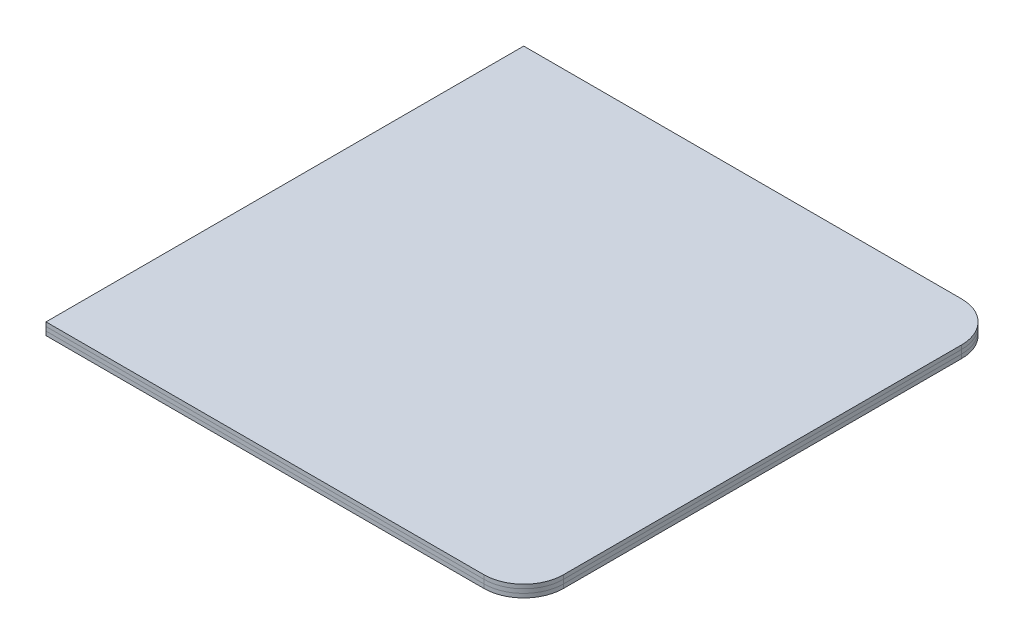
ISO-10303-21;
HEADER;
FILE_DESCRIPTION(('STEP AP214'),'2;1');
FILE_NAME('part.step','',(''),(''),'','','');
FILE_SCHEMA(('AUTOMOTIVE_DESIGN { 1 0 10303 214 1 1 1 1 }'));
ENDSEC;
DATA;
#1=APPLICATION_CONTEXT('core data for automotive mechanical design processes');
#2=APPLICATION_PROTOCOL_DEFINITION('international standard','automotive_design',2000,#1);
#3=PRODUCT_CONTEXT('',#1,'mechanical');
#4=PRODUCT('Part','Part','',(#3));
#5=PRODUCT_RELATED_PRODUCT_CATEGORY('part','',(#4));
#6=PRODUCT_DEFINITION_FORMATION('','',#4);
#7=PRODUCT_DEFINITION_CONTEXT('part definition',#1,'design');
#8=PRODUCT_DEFINITION('design','',#6,#7);
#9=PRODUCT_DEFINITION_SHAPE('','',#8);
#10=(LENGTH_UNIT() NAMED_UNIT(*) SI_UNIT(.MILLI.,.METRE.));
#11=(NAMED_UNIT(*) PLANE_ANGLE_UNIT() SI_UNIT($,.RADIAN.));
#12=(NAMED_UNIT(*) SI_UNIT($,.STERADIAN.) SOLID_ANGLE_UNIT());
#13=UNCERTAINTY_MEASURE_WITH_UNIT(LENGTH_MEASURE(1.E-05),#10,'distance_accuracy_value','');
#14=(GEOMETRIC_REPRESENTATION_CONTEXT(3) GLOBAL_UNCERTAINTY_ASSIGNED_CONTEXT((#13)) GLOBAL_UNIT_ASSIGNED_CONTEXT((#10,
#11,#12)) REPRESENTATION_CONTEXT('',''));
#15=CARTESIAN_POINT('',(0.,0.,0.));
#16=DIRECTION('',(0.,0.,1.));
#17=DIRECTION('',(1.,0.,0.));
#18=AXIS2_PLACEMENT_3D('',#15,#16,#17);
#19=CARTESIAN_POINT('',(-60.1958,3.,60.0396));
#20=DIRECTION('',(1.,0.,0.));
#21=DIRECTION('',(0.,0.,-1.));
#22=AXIS2_PLACEMENT_3D('',#19,#20,#21);
#23=PLANE('',#22);
#24=DIRECTION('',(0.,0.,1.));
#25=VECTOR('',#24,1.);
#26=CARTESIAN_POINT('',(-60.1958,2.,60.0396));
#27=LINE('',#26,#25);
#28=CARTESIAN_POINT('',(-60.1958,2.,-59.9604));
#29=VERTEX_POINT('',#28);
#30=CARTESIAN_POINT('',(-60.1958,2.,60.0396));
#31=VERTEX_POINT('',#30);
#32=EDGE_CURVE('E130',#29,#31,#27,.T.);
#33=ORIENTED_EDGE('',*,*,#32,.T.);
#34=DIRECTION('',(0.,-1.,0.));
#35=VECTOR('',#34,1.);
#36=CARTESIAN_POINT('',(-60.1958,3.,60.0396));
#37=LINE('',#36,#35);
#38=CARTESIAN_POINT('',(-60.1958,3.,60.0396));
#39=VERTEX_POINT('',#38);
#40=EDGE_CURVE('E12',#39,#31,#37,.T.);
#41=ORIENTED_EDGE('',*,*,#40,.F.);
#42=DIRECTION('',(0.,0.,1.));
#43=VECTOR('',#42,1.);
#44=CARTESIAN_POINT('',(-60.1958,3.,60.0396));
#45=LINE('',#44,#43);
#46=CARTESIAN_POINT('',(-60.1958,3.,-59.9604));
#47=VERTEX_POINT('',#46);
#48=EDGE_CURVE('E140',#47,#39,#45,.T.);
#49=ORIENTED_EDGE('',*,*,#48,.F.);
#50=DIRECTION('',(0.,-1.,0.));
#51=VECTOR('',#50,1.);
#52=CARTESIAN_POINT('',(-60.1958,3.,-59.9604));
#53=LINE('',#52,#51);
#54=EDGE_CURVE('E126',#47,#29,#53,.T.);
#55=ORIENTED_EDGE('',*,*,#54,.T.);
#56=EDGE_LOOP('',(#33,#41,#49,#55));
#57=FACE_BOUND('',#56,.T.);
#58=ADVANCED_FACE('F46',(#57),#23,.F.);
#59=CARTESIAN_POINT('',(49.8042,3.,60.0396));
#60=DIRECTION('',(0.,0.,-1.));
#61=DIRECTION('',(-1.,0.,0.));
#62=AXIS2_PLACEMENT_3D('',#59,#60,#61);
#63=PLANE('',#62);
#64=DIRECTION('',(1.,0.,0.));
#65=VECTOR('',#64,1.);
#66=CARTESIAN_POINT('',(49.8042,2.,60.0396));
#67=LINE('',#66,#65);
#68=CARTESIAN_POINT('',(49.8042,2.,60.0396));
#69=VERTEX_POINT('',#68);
#70=EDGE_CURVE('E133',#31,#69,#67,.T.);
#71=ORIENTED_EDGE('',*,*,#70,.T.);
#72=DIRECTION('',(0.,-1.,0.));
#73=VECTOR('',#72,1.);
#74=CARTESIAN_POINT('',(49.8042,3.,60.0396));
#75=LINE('',#74,#73);
#76=CARTESIAN_POINT('',(49.8042,3.,60.0396));
#77=VERTEX_POINT('',#76);
#78=EDGE_CURVE('E54',#77,#69,#75,.T.);
#79=ORIENTED_EDGE('',*,*,#78,.F.);
#80=DIRECTION('',(1.,0.,0.));
#81=VECTOR('',#80,1.);
#82=CARTESIAN_POINT('',(49.8042,3.,60.0396));
#83=LINE('',#82,#81);
#84=EDGE_CURVE('E99',#39,#77,#83,.T.);
#85=ORIENTED_EDGE('',*,*,#84,.F.);
#86=ORIENTED_EDGE('',*,*,#40,.T.);
#87=EDGE_LOOP('',(#71,#79,#85,#86));
#88=FACE_BOUND('',#87,.T.);
#89=ADVANCED_FACE('F164',(#88),#63,.F.);
#90=CARTESIAN_POINT('',(49.8042,3.,50.0396));
#91=DIRECTION('',(0.,-1.,0.));
#92=DIRECTION('',(0.,0.,-1.));
#93=AXIS2_PLACEMENT_3D('',#90,#91,#92);
#94=CYLINDRICAL_SURFACE('',#93,10.);
#95=CARTESIAN_POINT('',(49.8042,2.,50.0396));
#96=DIRECTION('',(0.,1.,0.));
#97=DIRECTION('',(0.,0.,1.));
#98=AXIS2_PLACEMENT_3D('',#95,#96,#97);
#99=CIRCLE('',#98,10.);
#100=CARTESIAN_POINT('',(59.8042,2.,50.0396));
#101=VERTEX_POINT('',#100);
#102=EDGE_CURVE('E135',#69,#101,#99,.T.);
#103=ORIENTED_EDGE('',*,*,#102,.T.);
#104=DIRECTION('',(0.,-1.,0.));
#105=VECTOR('',#104,1.);
#106=CARTESIAN_POINT('',(59.8042,3.,50.0396));
#107=LINE('',#106,#105);
#108=CARTESIAN_POINT('',(59.8042,3.,50.0396));
#109=VERTEX_POINT('',#108);
#110=EDGE_CURVE('E121',#109,#101,#107,.T.);
#111=ORIENTED_EDGE('',*,*,#110,.F.);
#112=CARTESIAN_POINT('',(49.8042,3.,50.0396));
#113=DIRECTION('',(0.,1.,0.));
#114=DIRECTION('',(0.,0.,1.));
#115=AXIS2_PLACEMENT_3D('',#112,#113,#114);
#116=CIRCLE('',#115,10.);
#117=EDGE_CURVE('E112',#77,#109,#116,.T.);
#118=ORIENTED_EDGE('',*,*,#117,.F.);
#119=ORIENTED_EDGE('',*,*,#78,.T.);
#120=EDGE_LOOP('',(#103,#111,#118,#119));
#121=FACE_BOUND('',#120,.T.);
#122=ADVANCED_FACE('F146',(#121),#94,.T.);
#123=CARTESIAN_POINT('',(59.8042,3.,-49.9604));
#124=DIRECTION('',(-1.,0.,0.));
#125=DIRECTION('',(0.,0.,1.));
#126=AXIS2_PLACEMENT_3D('',#123,#124,#125);
#127=PLANE('',#126);
#128=DIRECTION('',(0.,0.,-1.));
#129=VECTOR('',#128,1.);
#130=CARTESIAN_POINT('',(59.8042,2.,-49.9604));
#131=LINE('',#130,#129);
#132=CARTESIAN_POINT('',(59.8042,2.,-49.9604));
#133=VERTEX_POINT('',#132);
#134=EDGE_CURVE('E120',#101,#133,#131,.T.);
#135=ORIENTED_EDGE('',*,*,#134,.T.);
#136=DIRECTION('',(0.,-1.,0.));
#137=VECTOR('',#136,1.);
#138=CARTESIAN_POINT('',(59.8042,3.,-49.9604));
#139=LINE('',#138,#137);
#140=CARTESIAN_POINT('',(59.8042,3.,-49.9604));
#141=VERTEX_POINT('',#140);
#142=EDGE_CURVE('E117',#141,#133,#139,.T.);
#143=ORIENTED_EDGE('',*,*,#142,.F.);
#144=DIRECTION('',(0.,0.,-1.));
#145=VECTOR('',#144,1.);
#146=CARTESIAN_POINT('',(59.8042,3.,-49.9604));
#147=LINE('',#146,#145);
#148=EDGE_CURVE('E106',#109,#141,#147,.T.);
#149=ORIENTED_EDGE('',*,*,#148,.F.);
#150=ORIENTED_EDGE('',*,*,#110,.T.);
#151=EDGE_LOOP('',(#135,#143,#149,#150));
#152=FACE_BOUND('',#151,.T.);
#153=ADVANCED_FACE('F118',(#152),#127,.F.);
#154=CARTESIAN_POINT('',(49.8042,3.,-49.9604));
#155=DIRECTION('',(0.,-1.,0.));
#156=DIRECTION('',(0.,0.,-1.));
#157=AXIS2_PLACEMENT_3D('',#154,#155,#156);
#158=CYLINDRICAL_SURFACE('',#157,10.);
#159=CARTESIAN_POINT('',(49.8042,2.,-49.9604));
#160=DIRECTION('',(0.,1.,0.));
#161=DIRECTION('',(0.,0.,-1.));
#162=AXIS2_PLACEMENT_3D('',#159,#160,#161);
#163=CIRCLE('',#162,10.);
#164=CARTESIAN_POINT('',(49.8042,2.,-59.9604));
#165=VERTEX_POINT('',#164);
#166=EDGE_CURVE('E85',#133,#165,#163,.T.);
#167=ORIENTED_EDGE('',*,*,#166,.T.);
#168=DIRECTION('',(0.,-1.,0.));
#169=VECTOR('',#168,1.);
#170=CARTESIAN_POINT('',(49.8042,3.,-59.9604));
#171=LINE('',#170,#169);
#172=CARTESIAN_POINT('',(49.8042,3.,-59.9604));
#173=VERTEX_POINT('',#172);
#174=EDGE_CURVE('E122',#173,#165,#171,.T.);
#175=ORIENTED_EDGE('',*,*,#174,.F.);
#176=CARTESIAN_POINT('',(49.8042,3.,-49.9604));
#177=DIRECTION('',(0.,1.,0.));
#178=DIRECTION('',(0.,0.,-1.));
#179=AXIS2_PLACEMENT_3D('',#176,#177,#178);
#180=CIRCLE('',#179,10.);
#181=EDGE_CURVE('E110',#141,#173,#180,.T.);
#182=ORIENTED_EDGE('',*,*,#181,.F.);
#183=ORIENTED_EDGE('',*,*,#142,.T.);
#184=EDGE_LOOP('',(#167,#175,#182,#183));
#185=FACE_BOUND('',#184,.T.);
#186=ADVANCED_FACE('F124',(#185),#158,.T.);
#187=CARTESIAN_POINT('',(-60.1958,3.,-59.9604));
#188=DIRECTION('',(0.,0.,1.));
#189=DIRECTION('',(1.,0.,0.));
#190=AXIS2_PLACEMENT_3D('',#187,#188,#189);
#191=PLANE('',#190);
#192=DIRECTION('',(-1.,0.,0.));
#193=VECTOR('',#192,1.);
#194=CARTESIAN_POINT('',(-60.1958,2.,-59.9604));
#195=LINE('',#194,#193);
#196=EDGE_CURVE('E91',#165,#29,#195,.T.);
#197=ORIENTED_EDGE('',*,*,#196,.T.);
#198=ORIENTED_EDGE('',*,*,#54,.F.);
#199=DIRECTION('',(-1.,0.,0.));
#200=VECTOR('',#199,1.);
#201=CARTESIAN_POINT('',(-60.1958,3.,-59.9604));
#202=LINE('',#201,#200);
#203=EDGE_CURVE('E62',#173,#47,#202,.T.);
#204=ORIENTED_EDGE('',*,*,#203,.F.);
#205=ORIENTED_EDGE('',*,*,#174,.T.);
#206=EDGE_LOOP('',(#197,#198,#204,#205));
#207=FACE_BOUND('',#206,.T.);
#208=ADVANCED_FACE('F153',(#207),#191,.F.);
#209=CARTESIAN_POINT('',(49.8042,3.,-49.9604));
#210=DIRECTION('',(0.,-1.,0.));
#211=DIRECTION('',(0.,0.,-1.));
#212=AXIS2_PLACEMENT_3D('',#209,#210,#211);
#213=PLANE('',#212);
#214=ORIENTED_EDGE('',*,*,#48,.T.);
#215=ORIENTED_EDGE('',*,*,#84,.T.);
#216=ORIENTED_EDGE('',*,*,#117,.T.);
#217=ORIENTED_EDGE('',*,*,#148,.T.);
#218=ORIENTED_EDGE('',*,*,#181,.T.);
#219=ORIENTED_EDGE('',*,*,#203,.T.);
#220=EDGE_LOOP('',(#214,#215,#216,#217,#218,#219));
#221=FACE_BOUND('',#220,.T.);
#222=ADVANCED_FACE('F108',(#221),#213,.F.);
#223=CARTESIAN_POINT('',(49.8042,2.,-49.9604));
#224=DIRECTION('',(0.,-1.,0.));
#225=DIRECTION('',(0.,0.,-1.));
#226=AXIS2_PLACEMENT_3D('',#223,#224,#225);
#227=PLANE('',#226);
#228=ORIENTED_EDGE('',*,*,#32,.F.);
#229=ORIENTED_EDGE('',*,*,#196,.F.);
#230=ORIENTED_EDGE('',*,*,#166,.F.);
#231=ORIENTED_EDGE('',*,*,#134,.F.);
#232=ORIENTED_EDGE('',*,*,#102,.F.);
#233=ORIENTED_EDGE('',*,*,#70,.F.);
#234=EDGE_LOOP('',(#228,#229,#230,#231,#232,#233));
#235=FACE_BOUND('',#234,.T.);
#236=ADVANCED_FACE('F149',(#235),#227,.T.);
#237=CLOSED_SHELL('',(#58,#89,#122,#153,#186,#208,#222,#236));
#238=MANIFOLD_SOLID_BREP('B2',#237);
#239=CARTESIAN_POINT('',(-60.1958,2.,60.0396));
#240=DIRECTION('',(1.,0.,0.));
#241=DIRECTION('',(0.,0.,-1.));
#242=AXIS2_PLACEMENT_3D('',#239,#240,#241);
#243=PLANE('',#242);
#244=DIRECTION('',(0.,0.,1.));
#245=VECTOR('',#244,1.);
#246=CARTESIAN_POINT('',(-60.1958,1.,60.0396));
#247=LINE('',#246,#245);
#248=CARTESIAN_POINT('',(-60.1958,1.,-59.9604));
#249=VERTEX_POINT('',#248);
#250=CARTESIAN_POINT('',(-60.1958,1.,60.0396));
#251=VERTEX_POINT('',#250);
#252=EDGE_CURVE('E315',#249,#251,#247,.T.);
#253=ORIENTED_EDGE('',*,*,#252,.T.);
#254=DIRECTION('',(0.,-1.,0.));
#255=VECTOR('',#254,1.);
#256=CARTESIAN_POINT('',(-60.1958,2.,60.0396));
#257=LINE('',#256,#255);
#258=CARTESIAN_POINT('',(-60.1958,2.,60.0396));
#259=VERTEX_POINT('',#258);
#260=EDGE_CURVE('E44',#259,#251,#257,.T.);
#261=ORIENTED_EDGE('',*,*,#260,.F.);
#262=DIRECTION('',(0.,0.,1.));
#263=VECTOR('',#262,1.);
#264=CARTESIAN_POINT('',(-60.1958,2.,60.0396));
#265=LINE('',#264,#263);
#266=CARTESIAN_POINT('',(-60.1958,2.,-59.9604));
#267=VERTEX_POINT('',#266);
#268=EDGE_CURVE('E325',#267,#259,#265,.T.);
#269=ORIENTED_EDGE('',*,*,#268,.F.);
#270=DIRECTION('',(0.,-1.,0.));
#271=VECTOR('',#270,1.);
#272=CARTESIAN_POINT('',(-60.1958,2.,-59.9604));
#273=LINE('',#272,#271);
#274=EDGE_CURVE('E311',#267,#249,#273,.T.);
#275=ORIENTED_EDGE('',*,*,#274,.T.);
#276=EDGE_LOOP('',(#253,#261,#269,#275));
#277=FACE_BOUND('',#276,.T.);
#278=ADVANCED_FACE('F231',(#277),#243,.F.);
#279=CARTESIAN_POINT('',(49.8042,2.,60.0396));
#280=DIRECTION('',(0.,0.,-1.));
#281=DIRECTION('',(-1.,0.,0.));
#282=AXIS2_PLACEMENT_3D('',#279,#280,#281);
#283=PLANE('',#282);
#284=DIRECTION('',(1.,0.,0.));
#285=VECTOR('',#284,1.);
#286=CARTESIAN_POINT('',(49.8042,1.,60.0396));
#287=LINE('',#286,#285);
#288=CARTESIAN_POINT('',(49.8042,1.,60.0396));
#289=VERTEX_POINT('',#288);
#290=EDGE_CURVE('E318',#251,#289,#287,.T.);
#291=ORIENTED_EDGE('',*,*,#290,.T.);
#292=DIRECTION('',(0.,-1.,0.));
#293=VECTOR('',#292,1.);
#294=CARTESIAN_POINT('',(49.8042,2.,60.0396));
#295=LINE('',#294,#293);
#296=CARTESIAN_POINT('',(49.8042,2.,60.0396));
#297=VERTEX_POINT('',#296);
#298=EDGE_CURVE('E239',#297,#289,#295,.T.);
#299=ORIENTED_EDGE('',*,*,#298,.F.);
#300=DIRECTION('',(1.,0.,0.));
#301=VECTOR('',#300,1.);
#302=CARTESIAN_POINT('',(49.8042,2.,60.0396));
#303=LINE('',#302,#301);
#304=EDGE_CURVE('E284',#259,#297,#303,.T.);
#305=ORIENTED_EDGE('',*,*,#304,.F.);
#306=ORIENTED_EDGE('',*,*,#260,.T.);
#307=EDGE_LOOP('',(#291,#299,#305,#306));
#308=FACE_BOUND('',#307,.T.);
#309=ADVANCED_FACE('F349',(#308),#283,.F.);
#310=CARTESIAN_POINT('',(49.8042,2.,50.0396));
#311=DIRECTION('',(0.,-1.,0.));
#312=DIRECTION('',(0.,0.,-1.));
#313=AXIS2_PLACEMENT_3D('',#310,#311,#312);
#314=CYLINDRICAL_SURFACE('',#313,10.);
#315=CARTESIAN_POINT('',(49.8042,1.,50.0396));
#316=DIRECTION('',(0.,1.,0.));
#317=DIRECTION('',(0.,0.,1.));
#318=AXIS2_PLACEMENT_3D('',#315,#316,#317);
#319=CIRCLE('',#318,10.);
#320=CARTESIAN_POINT('',(59.8042,1.,50.0396));
#321=VERTEX_POINT('',#320);
#322=EDGE_CURVE('E320',#289,#321,#319,.T.);
#323=ORIENTED_EDGE('',*,*,#322,.T.);
#324=DIRECTION('',(0.,-1.,0.));
#325=VECTOR('',#324,1.);
#326=CARTESIAN_POINT('',(59.8042,2.,50.0396));
#327=LINE('',#326,#325);
#328=CARTESIAN_POINT('',(59.8042,2.,50.0396));
#329=VERTEX_POINT('',#328);
#330=EDGE_CURVE('E306',#329,#321,#327,.T.);
#331=ORIENTED_EDGE('',*,*,#330,.F.);
#332=CARTESIAN_POINT('',(49.8042,2.,50.0396));
#333=DIRECTION('',(0.,1.,0.));
#334=DIRECTION('',(0.,0.,1.));
#335=AXIS2_PLACEMENT_3D('',#332,#333,#334);
#336=CIRCLE('',#335,10.);
#337=EDGE_CURVE('E297',#297,#329,#336,.T.);
#338=ORIENTED_EDGE('',*,*,#337,.F.);
#339=ORIENTED_EDGE('',*,*,#298,.T.);
#340=EDGE_LOOP('',(#323,#331,#338,#339));
#341=FACE_BOUND('',#340,.T.);
#342=ADVANCED_FACE('F331',(#341),#314,.T.);
#343=CARTESIAN_POINT('',(59.8042,2.,-49.9604));
#344=DIRECTION('',(-1.,0.,0.));
#345=DIRECTION('',(0.,0.,1.));
#346=AXIS2_PLACEMENT_3D('',#343,#344,#345);
#347=PLANE('',#346);
#348=DIRECTION('',(0.,0.,-1.));
#349=VECTOR('',#348,1.);
#350=CARTESIAN_POINT('',(59.8042,1.,-49.9604));
#351=LINE('',#350,#349);
#352=CARTESIAN_POINT('',(59.8042,1.,-49.9604));
#353=VERTEX_POINT('',#352);
#354=EDGE_CURVE('E305',#321,#353,#351,.T.);
#355=ORIENTED_EDGE('',*,*,#354,.T.);
#356=DIRECTION('',(0.,-1.,0.));
#357=VECTOR('',#356,1.);
#358=CARTESIAN_POINT('',(59.8042,2.,-49.9604));
#359=LINE('',#358,#357);
#360=CARTESIAN_POINT('',(59.8042,2.,-49.9604));
#361=VERTEX_POINT('',#360);
#362=EDGE_CURVE('E302',#361,#353,#359,.T.);
#363=ORIENTED_EDGE('',*,*,#362,.F.);
#364=DIRECTION('',(0.,0.,-1.));
#365=VECTOR('',#364,1.);
#366=CARTESIAN_POINT('',(59.8042,2.,-49.9604));
#367=LINE('',#366,#365);
#368=EDGE_CURVE('E291',#329,#361,#367,.T.);
#369=ORIENTED_EDGE('',*,*,#368,.F.);
#370=ORIENTED_EDGE('',*,*,#330,.T.);
#371=EDGE_LOOP('',(#355,#363,#369,#370));
#372=FACE_BOUND('',#371,.T.);
#373=ADVANCED_FACE('F303',(#372),#347,.F.);
#374=CARTESIAN_POINT('',(49.8042,2.,-49.9604));
#375=DIRECTION('',(0.,-1.,0.));
#376=DIRECTION('',(0.,0.,-1.));
#377=AXIS2_PLACEMENT_3D('',#374,#375,#376);
#378=CYLINDRICAL_SURFACE('',#377,10.);
#379=CARTESIAN_POINT('',(49.8042,1.,-49.9604));
#380=DIRECTION('',(0.,1.,0.));
#381=DIRECTION('',(0.,0.,-1.));
#382=AXIS2_PLACEMENT_3D('',#379,#380,#381);
#383=CIRCLE('',#382,10.);
#384=CARTESIAN_POINT('',(49.8042,1.,-59.9604));
#385=VERTEX_POINT('',#384);
#386=EDGE_CURVE('E270',#353,#385,#383,.T.);
#387=ORIENTED_EDGE('',*,*,#386,.T.);
#388=DIRECTION('',(0.,-1.,0.));
#389=VECTOR('',#388,1.);
#390=CARTESIAN_POINT('',(49.8042,2.,-59.9604));
#391=LINE('',#390,#389);
#392=CARTESIAN_POINT('',(49.8042,2.,-59.9604));
#393=VERTEX_POINT('',#392);
#394=EDGE_CURVE('E307',#393,#385,#391,.T.);
#395=ORIENTED_EDGE('',*,*,#394,.F.);
#396=CARTESIAN_POINT('',(49.8042,2.,-49.9604));
#397=DIRECTION('',(0.,1.,0.));
#398=DIRECTION('',(0.,0.,-1.));
#399=AXIS2_PLACEMENT_3D('',#396,#397,#398);
#400=CIRCLE('',#399,10.);
#401=EDGE_CURVE('E295',#361,#393,#400,.T.);
#402=ORIENTED_EDGE('',*,*,#401,.F.);
#403=ORIENTED_EDGE('',*,*,#362,.T.);
#404=EDGE_LOOP('',(#387,#395,#402,#403));
#405=FACE_BOUND('',#404,.T.);
#406=ADVANCED_FACE('F309',(#405),#378,.T.);
#407=CARTESIAN_POINT('',(-60.1958,2.,-59.9604));
#408=DIRECTION('',(0.,0.,1.));
#409=DIRECTION('',(1.,0.,0.));
#410=AXIS2_PLACEMENT_3D('',#407,#408,#409);
#411=PLANE('',#410);
#412=DIRECTION('',(-1.,0.,0.));
#413=VECTOR('',#412,1.);
#414=CARTESIAN_POINT('',(-60.1958,1.,-59.9604));
#415=LINE('',#414,#413);
#416=EDGE_CURVE('E276',#385,#249,#415,.T.);
#417=ORIENTED_EDGE('',*,*,#416,.T.);
#418=ORIENTED_EDGE('',*,*,#274,.F.);
#419=DIRECTION('',(-1.,0.,0.));
#420=VECTOR('',#419,1.);
#421=CARTESIAN_POINT('',(-60.1958,2.,-59.9604));
#422=LINE('',#421,#420);
#423=EDGE_CURVE('E247',#393,#267,#422,.T.);
#424=ORIENTED_EDGE('',*,*,#423,.F.);
#425=ORIENTED_EDGE('',*,*,#394,.T.);
#426=EDGE_LOOP('',(#417,#418,#424,#425));
#427=FACE_BOUND('',#426,.T.);
#428=ADVANCED_FACE('F338',(#427),#411,.F.);
#429=CARTESIAN_POINT('',(49.8042,2.,-49.9604));
#430=DIRECTION('',(0.,-1.,0.));
#431=DIRECTION('',(0.,0.,-1.));
#432=AXIS2_PLACEMENT_3D('',#429,#430,#431);
#433=PLANE('',#432);
#434=ORIENTED_EDGE('',*,*,#268,.T.);
#435=ORIENTED_EDGE('',*,*,#304,.T.);
#436=ORIENTED_EDGE('',*,*,#337,.T.);
#437=ORIENTED_EDGE('',*,*,#368,.T.);
#438=ORIENTED_EDGE('',*,*,#401,.T.);
#439=ORIENTED_EDGE('',*,*,#423,.T.);
#440=EDGE_LOOP('',(#434,#435,#436,#437,#438,#439));
#441=FACE_BOUND('',#440,.T.);
#442=ADVANCED_FACE('F293',(#441),#433,.F.);
#443=CARTESIAN_POINT('',(49.8042,1.,-49.9604));
#444=DIRECTION('',(0.,-1.,0.));
#445=DIRECTION('',(0.,0.,-1.));
#446=AXIS2_PLACEMENT_3D('',#443,#444,#445);
#447=PLANE('',#446);
#448=ORIENTED_EDGE('',*,*,#252,.F.);
#449=ORIENTED_EDGE('',*,*,#416,.F.);
#450=ORIENTED_EDGE('',*,*,#386,.F.);
#451=ORIENTED_EDGE('',*,*,#354,.F.);
#452=ORIENTED_EDGE('',*,*,#322,.F.);
#453=ORIENTED_EDGE('',*,*,#290,.F.);
#454=EDGE_LOOP('',(#448,#449,#450,#451,#452,#453));
#455=FACE_BOUND('',#454,.T.);
#456=ADVANCED_FACE('F334',(#455),#447,.T.);
#457=CLOSED_SHELL('',(#278,#309,#342,#373,#406,#428,#442,#456));
#458=MANIFOLD_SOLID_BREP('B6',#457);
#459=CARTESIAN_POINT('',(-60.1958,1.,60.0396));
#460=DIRECTION('',(1.,0.,0.));
#461=DIRECTION('',(0.,0.,-1.));
#462=AXIS2_PLACEMENT_3D('',#459,#460,#461);
#463=PLANE('',#462);
#464=DIRECTION('',(0.,0.,1.));
#465=VECTOR('',#464,1.);
#466=CARTESIAN_POINT('',(-60.1958,0.,60.0396));
#467=LINE('',#466,#465);
#468=CARTESIAN_POINT('',(-60.1958,0.,-59.9604));
#469=VERTEX_POINT('',#468);
#470=CARTESIAN_POINT('',(-60.1958,0.,60.0396));
#471=VERTEX_POINT('',#470);
#472=EDGE_CURVE('E491',#469,#471,#467,.T.);
#473=ORIENTED_EDGE('',*,*,#472,.T.);
#474=DIRECTION('',(0.,-1.,0.));
#475=VECTOR('',#474,1.);
#476=CARTESIAN_POINT('',(-60.1958,1.,60.0396));
#477=LINE('',#476,#475);
#478=CARTESIAN_POINT('',(-60.1958,1.,60.0396));
#479=VERTEX_POINT('',#478);
#480=EDGE_CURVE('E229',#479,#471,#477,.T.);
#481=ORIENTED_EDGE('',*,*,#480,.F.);
#482=DIRECTION('',(0.,0.,1.));
#483=VECTOR('',#482,1.);
#484=CARTESIAN_POINT('',(-60.1958,1.,60.0396));
#485=LINE('',#484,#483);
#486=CARTESIAN_POINT('',(-60.1958,1.,-59.9604));
#487=VERTEX_POINT('',#486);
#488=EDGE_CURVE('E501',#487,#479,#485,.T.);
#489=ORIENTED_EDGE('',*,*,#488,.F.);
#490=DIRECTION('',(0.,-1.,0.));
#491=VECTOR('',#490,1.);
#492=CARTESIAN_POINT('',(-60.1958,1.,-59.9604));
#493=LINE('',#492,#491);
#494=EDGE_CURVE('E487',#487,#469,#493,.T.);
#495=ORIENTED_EDGE('',*,*,#494,.T.);
#496=EDGE_LOOP('',(#473,#481,#489,#495));
#497=FACE_BOUND('',#496,.T.);
#498=ADVANCED_FACE('F407',(#497),#463,.F.);
#499=CARTESIAN_POINT('',(49.8042,1.,60.0396));
#500=DIRECTION('',(0.,0.,-1.));
#501=DIRECTION('',(-1.,0.,0.));
#502=AXIS2_PLACEMENT_3D('',#499,#500,#501);
#503=PLANE('',#502);
#504=DIRECTION('',(1.,0.,0.));
#505=VECTOR('',#504,1.);
#506=CARTESIAN_POINT('',(49.8042,0.,60.0396));
#507=LINE('',#506,#505);
#508=CARTESIAN_POINT('',(49.8042,0.,60.0396));
#509=VERTEX_POINT('',#508);
#510=EDGE_CURVE('E494',#471,#509,#507,.T.);
#511=ORIENTED_EDGE('',*,*,#510,.T.);
#512=DIRECTION('',(0.,-1.,0.));
#513=VECTOR('',#512,1.);
#514=CARTESIAN_POINT('',(49.8042,1.,60.0396));
#515=LINE('',#514,#513);
#516=CARTESIAN_POINT('',(49.8042,1.,60.0396));
#517=VERTEX_POINT('',#516);
#518=EDGE_CURVE('E415',#517,#509,#515,.T.);
#519=ORIENTED_EDGE('',*,*,#518,.F.);
#520=DIRECTION('',(1.,0.,0.));
#521=VECTOR('',#520,1.);
#522=CARTESIAN_POINT('',(49.8042,1.,60.0396));
#523=LINE('',#522,#521);
#524=EDGE_CURVE('E460',#479,#517,#523,.T.);
#525=ORIENTED_EDGE('',*,*,#524,.F.);
#526=ORIENTED_EDGE('',*,*,#480,.T.);
#527=EDGE_LOOP('',(#511,#519,#525,#526));
#528=FACE_BOUND('',#527,.T.);
#529=ADVANCED_FACE('F525',(#528),#503,.F.);
#530=CARTESIAN_POINT('',(49.8042,1.,50.0396));
#531=DIRECTION('',(0.,-1.,0.));
#532=DIRECTION('',(0.,0.,-1.));
#533=AXIS2_PLACEMENT_3D('',#530,#531,#532);
#534=CYLINDRICAL_SURFACE('',#533,10.);
#535=CARTESIAN_POINT('',(49.8042,0.,50.0396));
#536=DIRECTION('',(0.,1.,0.));
#537=DIRECTION('',(0.,0.,1.));
#538=AXIS2_PLACEMENT_3D('',#535,#536,#537);
#539=CIRCLE('',#538,10.);
#540=CARTESIAN_POINT('',(59.8042,0.,50.0396));
#541=VERTEX_POINT('',#540);
#542=EDGE_CURVE('E496',#509,#541,#539,.T.);
#543=ORIENTED_EDGE('',*,*,#542,.T.);
#544=DIRECTION('',(0.,-1.,0.));
#545=VECTOR('',#544,1.);
#546=CARTESIAN_POINT('',(59.8042,1.,50.0396));
#547=LINE('',#546,#545);
#548=CARTESIAN_POINT('',(59.8042,1.,50.0396));
#549=VERTEX_POINT('',#548);
#550=EDGE_CURVE('E482',#549,#541,#547,.T.);
#551=ORIENTED_EDGE('',*,*,#550,.F.);
#552=CARTESIAN_POINT('',(49.8042,1.,50.0396));
#553=DIRECTION('',(0.,1.,0.));
#554=DIRECTION('',(0.,0.,1.));
#555=AXIS2_PLACEMENT_3D('',#552,#553,#554);
#556=CIRCLE('',#555,10.);
#557=EDGE_CURVE('E473',#517,#549,#556,.T.);
#558=ORIENTED_EDGE('',*,*,#557,.F.);
#559=ORIENTED_EDGE('',*,*,#518,.T.);
#560=EDGE_LOOP('',(#543,#551,#558,#559));
#561=FACE_BOUND('',#560,.T.);
#562=ADVANCED_FACE('F507',(#561),#534,.T.);
#563=CARTESIAN_POINT('',(59.8042,1.,-49.9604));
#564=DIRECTION('',(-1.,0.,0.));
#565=DIRECTION('',(0.,0.,1.));
#566=AXIS2_PLACEMENT_3D('',#563,#564,#565);
#567=PLANE('',#566);
#568=DIRECTION('',(0.,0.,-1.));
#569=VECTOR('',#568,1.);
#570=CARTESIAN_POINT('',(59.8042,0.,-49.9604));
#571=LINE('',#570,#569);
#572=CARTESIAN_POINT('',(59.8042,0.,-49.9604));
#573=VERTEX_POINT('',#572);
#574=EDGE_CURVE('E481',#541,#573,#571,.T.);
#575=ORIENTED_EDGE('',*,*,#574,.T.);
#576=DIRECTION('',(0.,-1.,0.));
#577=VECTOR('',#576,1.);
#578=CARTESIAN_POINT('',(59.8042,1.,-49.9604));
#579=LINE('',#578,#577);
#580=CARTESIAN_POINT('',(59.8042,1.,-49.9604));
#581=VERTEX_POINT('',#580);
#582=EDGE_CURVE('E478',#581,#573,#579,.T.);
#583=ORIENTED_EDGE('',*,*,#582,.F.);
#584=DIRECTION('',(0.,0.,-1.));
#585=VECTOR('',#584,1.);
#586=CARTESIAN_POINT('',(59.8042,1.,-49.9604));
#587=LINE('',#586,#585);
#588=EDGE_CURVE('E467',#549,#581,#587,.T.);
#589=ORIENTED_EDGE('',*,*,#588,.F.);
#590=ORIENTED_EDGE('',*,*,#550,.T.);
#591=EDGE_LOOP('',(#575,#583,#589,#590));
#592=FACE_BOUND('',#591,.T.);
#593=ADVANCED_FACE('F479',(#592),#567,.F.);
#594=CARTESIAN_POINT('',(49.8042,1.,-49.9604));
#595=DIRECTION('',(0.,-1.,0.));
#596=DIRECTION('',(0.,0.,-1.));
#597=AXIS2_PLACEMENT_3D('',#594,#595,#596);
#598=CYLINDRICAL_SURFACE('',#597,10.);
#599=CARTESIAN_POINT('',(49.8042,0.,-49.9604));
#600=DIRECTION('',(0.,1.,0.));
#601=DIRECTION('',(0.,0.,-1.));
#602=AXIS2_PLACEMENT_3D('',#599,#600,#601);
#603=CIRCLE('',#602,10.);
#604=CARTESIAN_POINT('',(49.8042,0.,-59.9604));
#605=VERTEX_POINT('',#604);
#606=EDGE_CURVE('E446',#573,#605,#603,.T.);
#607=ORIENTED_EDGE('',*,*,#606,.T.);
#608=DIRECTION('',(0.,-1.,0.));
#609=VECTOR('',#608,1.);
#610=CARTESIAN_POINT('',(49.8042,1.,-59.9604));
#611=LINE('',#610,#609);
#612=CARTESIAN_POINT('',(49.8042,1.,-59.9604));
#613=VERTEX_POINT('',#612);
#614=EDGE_CURVE('E483',#613,#605,#611,.T.);
#615=ORIENTED_EDGE('',*,*,#614,.F.);
#616=CARTESIAN_POINT('',(49.8042,1.,-49.9604));
#617=DIRECTION('',(0.,1.,0.));
#618=DIRECTION('',(0.,0.,-1.));
#619=AXIS2_PLACEMENT_3D('',#616,#617,#618);
#620=CIRCLE('',#619,10.);
#621=EDGE_CURVE('E471',#581,#613,#620,.T.);
#622=ORIENTED_EDGE('',*,*,#621,.F.);
#623=ORIENTED_EDGE('',*,*,#582,.T.);
#624=EDGE_LOOP('',(#607,#615,#622,#623));
#625=FACE_BOUND('',#624,.T.);
#626=ADVANCED_FACE('F485',(#625),#598,.T.);
#627=CARTESIAN_POINT('',(-60.1958,1.,-59.9604));
#628=DIRECTION('',(0.,0.,1.));
#629=DIRECTION('',(1.,0.,0.));
#630=AXIS2_PLACEMENT_3D('',#627,#628,#629);
#631=PLANE('',#630);
#632=DIRECTION('',(-1.,0.,0.));
#633=VECTOR('',#632,1.);
#634=CARTESIAN_POINT('',(-60.1958,0.,-59.9604));
#635=LINE('',#634,#633);
#636=EDGE_CURVE('E452',#605,#469,#635,.T.);
#637=ORIENTED_EDGE('',*,*,#636,.T.);
#638=ORIENTED_EDGE('',*,*,#494,.F.);
#639=DIRECTION('',(-1.,0.,0.));
#640=VECTOR('',#639,1.);
#641=CARTESIAN_POINT('',(-60.1958,1.,-59.9604));
#642=LINE('',#641,#640);
#643=EDGE_CURVE('E423',#613,#487,#642,.T.);
#644=ORIENTED_EDGE('',*,*,#643,.F.);
#645=ORIENTED_EDGE('',*,*,#614,.T.);
#646=EDGE_LOOP('',(#637,#638,#644,#645));
#647=FACE_BOUND('',#646,.T.);
#648=ADVANCED_FACE('F514',(#647),#631,.F.);
#649=CARTESIAN_POINT('',(49.8042,1.,-49.9604));
#650=DIRECTION('',(0.,-1.,0.));
#651=DIRECTION('',(0.,0.,-1.));
#652=AXIS2_PLACEMENT_3D('',#649,#650,#651);
#653=PLANE('',#652);
#654=ORIENTED_EDGE('',*,*,#488,.T.);
#655=ORIENTED_EDGE('',*,*,#524,.T.);
#656=ORIENTED_EDGE('',*,*,#557,.T.);
#657=ORIENTED_EDGE('',*,*,#588,.T.);
#658=ORIENTED_EDGE('',*,*,#621,.T.);
#659=ORIENTED_EDGE('',*,*,#643,.T.);
#660=EDGE_LOOP('',(#654,#655,#656,#657,#658,#659));
#661=FACE_BOUND('',#660,.T.);
#662=ADVANCED_FACE('F469',(#661),#653,.F.);
#663=CARTESIAN_POINT('',(49.8042,0.,-49.9604));
#664=DIRECTION('',(0.,-1.,0.));
#665=DIRECTION('',(0.,0.,-1.));
#666=AXIS2_PLACEMENT_3D('',#663,#664,#665);
#667=PLANE('',#666);
#668=ORIENTED_EDGE('',*,*,#472,.F.);
#669=ORIENTED_EDGE('',*,*,#636,.F.);
#670=ORIENTED_EDGE('',*,*,#606,.F.);
#671=ORIENTED_EDGE('',*,*,#574,.F.);
#672=ORIENTED_EDGE('',*,*,#542,.F.);
#673=ORIENTED_EDGE('',*,*,#510,.F.);
#674=EDGE_LOOP('',(#668,#669,#670,#671,#672,#673));
#675=FACE_BOUND('',#674,.T.);
#676=ADVANCED_FACE('F510',(#675),#667,.T.);
#677=CLOSED_SHELL('',(#498,#529,#562,#593,#626,#648,#662,#676));
#678=MANIFOLD_SOLID_BREP('B38',#677);
#679=ADVANCED_BREP_SHAPE_REPRESENTATION('',(#18,#238,#458,#678),#14);
#680=SHAPE_DEFINITION_REPRESENTATION(#9,#679);
ENDSEC;
END-ISO-10303-21;
